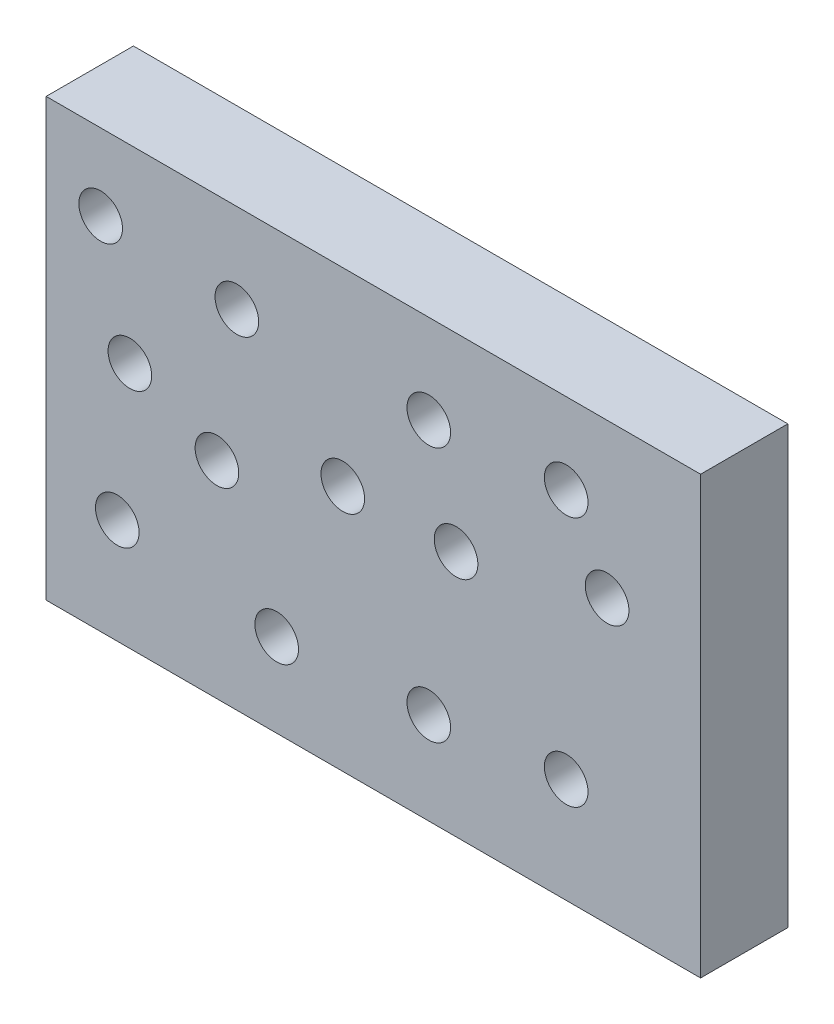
from build123d import *

# Parameters (mm, degrees)
SZKIC1_W                    = 300
SZKIC1_H                    = 200
DODANIE_WYCI_GNI_CIE1_DEPTH = 40
OTWORY_USTALAJ_CE_20_0MM1_D = 20


with BuildPart() as part:
    # Szkic1 → Dodanie-wyci_gni_cie1 (new body)
    with BuildSketch(Plane.XY):
        with Locations((150, 100)):
            Rectangle(SZKIC1_W, SZKIC1_H)
    extrude(amount=DODANIE_WYCI_GNI_CIE1_DEPTH)

    # Otwory ustalaj_ce _20.0mm1 (through all)
    with Locations(Plane.XY.offset(40)):
        with Locations((25, 165), (38.3780042, 113.205738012), (87.419192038, 159.203096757), (78.284068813, 94.631274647), (32.60845269, 48.089441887), (105.689438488, 38.321771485), (135.979583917, 113.205738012), (187.905547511, 113.205738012), (175.404852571, 159.203096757), (175.404852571, 42.174728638), (238.389123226, 48.089441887), (257.140165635, 129.407381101), (238.389123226, 162.959045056)):
            Hole(OTWORY_USTALAJ_CE_20_0MM1_D / 2)


solid = part.part
